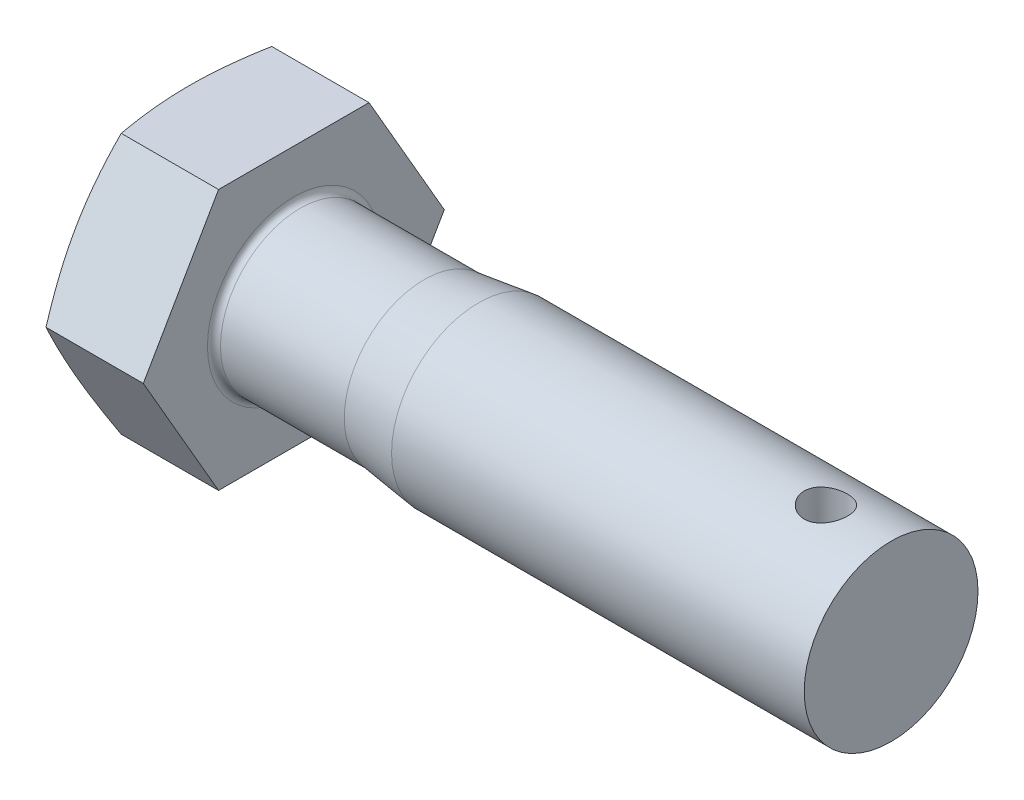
from build123d import *

# Parameters (mm, degrees)
BASEHEAD_DEPTH     = 10
SKETCH2_R          = 8
BASEBODY_DEPTH     = 55
SKETCH4_R          = 8.85
CUT_EXTRUDE1_DEPTH = 2
HEADFILLET_R       = 0.6
HOLE_DEPTH         = 68.53517602
HOLE_DEPTH_BACK    = 68.53517602
SKETCH6_R          = 2


with BuildPart() as part:
    # Sketch1 → BaseHead (new body)
    with BuildSketch(Plane(origin=(0, 0, 0), x_dir=(0, 0, -1), z_dir=(1, 0, 0))):
        Polygon((6.92820323, -12), (13.856406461, 0), (6.92820323, 12), (-6.92820323, 12), (-13.856406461, 0), (-6.92820323, -12), align=None)
    extrude(amount=BASEHEAD_DEPTH)

    # Sketch2 → BaseBody (add)
    with BuildSketch(Plane(origin=(10, 0, 0), x_dir=(0, 0, -1), z_dir=(1, 0, 0))):
        with Locations(Location((0, 0, 0), (0, 0, 180))):
            Circle(SKETCH2_R)
    extrude(amount=BASEBODY_DEPTH)

    # Sketch3 → HeadChamfer (revolve, cut)
    with BuildSketch(Plane(origin=(3.161211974, 0, 2.612290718), x_dir=(0, 0, -1), z_dir=(0, 1, 0)), mode=Mode.PRIVATE) as headchamfer_sk:
        Polygon((16.468697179, 3.161211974), (16.468697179, 2.121565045), (13.612290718, 3.161211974), align=None)
    revolve(headchamfer_sk.sketch.rotate(Axis((1.089857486, 0, 0), (1, 0, 0)), 180), axis=Axis((1.089857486, 0, 0), (1, 0, 0)), mode=Mode.SUBTRACT)

    # Sketch4 → Cut-Extrude1 (cut)
    with BuildSketch(Plane(origin=(0, 0, 0), x_dir=(0, 0, -1), z_dir=(1, 0, 0))):
        Circle(SKETCH4_R)
    extrude(amount=CUT_EXTRUDE1_DEPTH, mode=Mode.SUBTRACT)

    # Sketch5 → Cut-Revolve1 (revolve, cut)
    with BuildSketch(Plane(origin=(-2.92963122, 0, 7.92963122), x_dir=(0, 0, -1), z_dir=(0, 1, 0)), mode=Mode.PRIVATE) as cut_revolve1_sk:
        Polygon((15.92963122, -29.92963122), (15.28013122, -24.92963122), (15.28013122, -12.92963122), (22.63063122, -12.92963122), (22.63063122, -29.92963122), align=None)
    revolve(cut_revolve1_sk.sketch.rotate(Axis((0, 0, 0), (1, 0, 0)), 180), axis=Axis((0, 0, 0), (1, 0, 0)), mode=Mode.SUBTRACT)

    # HeadFillet
    headfillet_edges = [part.edges().sort_by_distance(p)[0] for p in [
        (10, 0, -7.3505),
    ]]
    fillet(headfillet_edges, radius=HEADFILLET_R)

    # Sketch6 → Hole (cut, two sides: drawn at the far end of the back side and taken through both)
    with BuildSketch(Plane(origin=(0, 0, 0), x_dir=(1, 0, 0), z_dir=(0, 1, 0)).offset(-HOLE_DEPTH_BACK)):
        with Locations(Location((59, 0, 0), (0, 0, 270))):
            Circle(SKETCH6_R)
    extrude(amount=HOLE_DEPTH + HOLE_DEPTH_BACK, mode=Mode.SUBTRACT)


solid = part.part
